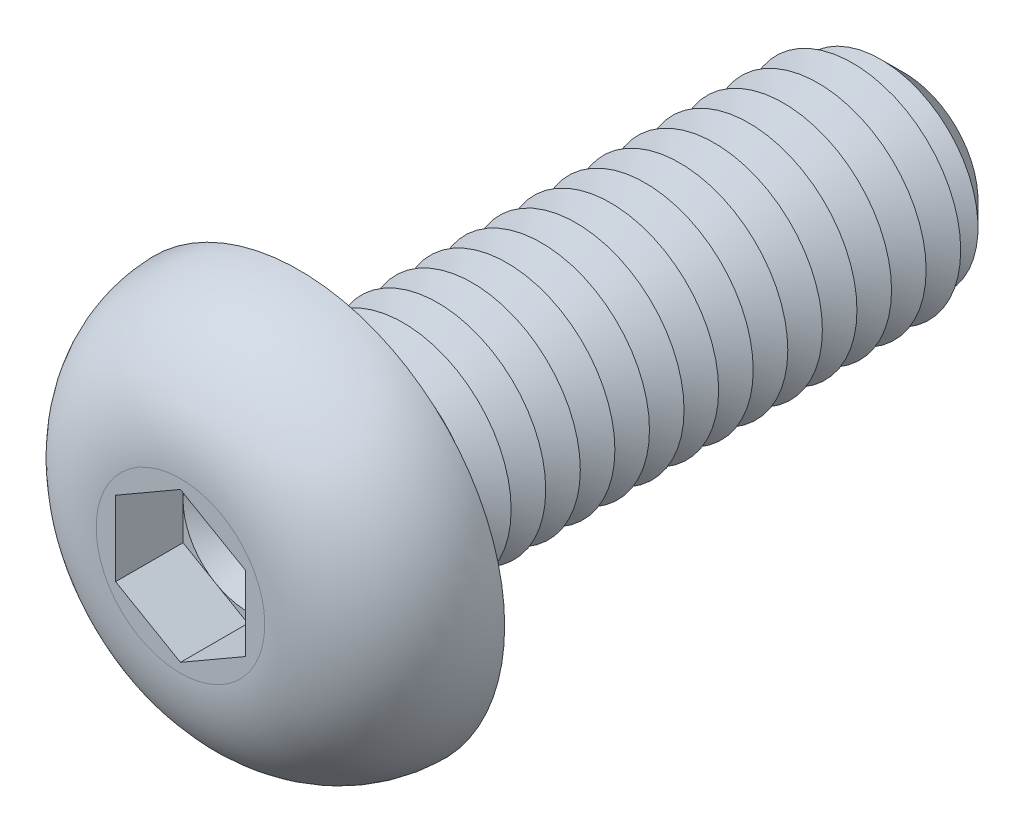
from build123d import *

# Parameters (mm, degrees)
CUT_EXTRUDE1_DEPTH  = 1.56
SKETCH4_R           = 2.5
BOSS_EXTRUDE1_DEPTH = 14
CHAMFER1_SIZE       = 0.8
LPATTERN1_COUNT     = 16
LPATTERN1_PITCH     = 0.8
FILLET2_R           = 0.4


with BuildPart() as part:
    # Sketch2 → Revolve1 (revolve)
    with BuildSketch(Plane(origin=(0, 0, 0), x_dir=(0, 0, -1), z_dir=(1, 0, 0)), mode=Mode.PRIVATE) as revolve1_sk:
        with BuildLine():
            Line((0, 0), (-2.75, 0))
            Line((-2.75, 0), (-2.75, 1.950446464))
            ThreePointArc((-2.75, 1.950446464), (-1.947498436, 3.912588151), (0, 4.75))
            Line((0, 4.75), (0, 0))
        make_face()
    revolve(revolve1_sk.sketch.rotate(Axis((0, 0, 47.934239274), (0, 0, -1)), 90), axis=Axis((0, 0, 47.934239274), (0, 0, -1)))

    # Sketch3 → Cut-Extrude1 (cut)
    with BuildSketch(Plane.XY.offset(2.75)):
        Polygon((0, 1.732050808), (-1.5, 0.866025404), (-1.5, -0.866025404), (0, -1.732050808), (1.5, -0.866025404), (1.5, 0.866025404), align=None)
    extrude(amount=-CUT_EXTRUDE1_DEPTH, mode=Mode.SUBTRACT)

    # Sketch4 → Boss-Extrude1 (add)
    with BuildSketch(Plane(origin=(0, 0, 0), x_dir=(-1, 0, 0), z_dir=(0, 0, -1))):
        with Locations(Location((0, 0, 0), (0, 0, 180))):
            Circle(SKETCH4_R)
    extrude(amount=BOSS_EXTRUDE1_DEPTH)

    # Chamfer1
    chamfer1_edges = [part.edges().sort_by_distance(p)[0] for p in [
        (-2.5, 0, -14),
    ]]
    chamfer(chamfer1_edges, length=CHAMFER1_SIZE)

    # Sketch5 → Cut-Revolve1 (revolve, cut)
    with BuildSketch(Plane(origin=(0, 0, 0), x_dir=(0, 0, -1), z_dir=(1, 0, 0)), mode=Mode.PRIVATE) as cut_revolve1_sk:
        Polygon((0.8, 2.5), (1.6, 2.5), (1.2, 1.807179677), align=None)
    cut_revolve1 = revolve(cut_revolve1_sk.sketch.rotate(Axis((0, 0, 47.934239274), (0, 0, -1)), 90), axis=Axis((0, 0, 47.934239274), (0, 0, -1)), mode=Mode.SUBTRACT)

    # LPattern1: Cut-Revolve1 ×16
    with Locations(*[(0, 0, -i * LPATTERN1_PITCH) for i in range(1, LPATTERN1_COUNT)]):
        add(cut_revolve1, mode=Mode.SUBTRACT)

    # Fillet2
    fillet2_edges = [part.edges().sort_by_distance(p)[0] for p in [
        (-2.5, 0, 0),
    ]]
    fillet(fillet2_edges, radius=FILLET2_R)

    # Cut-Extrude2 cone 1 section (on through the dimple's axis) → Cut-Extrude2 (revolve, cut)
    with BuildSketch(Plane(origin=(0, 0, 1.19), x_dir=(0, -1, 0), z_dir=(1, 0, 0))):
        Polygon((0, 0), (1.5, 0), (0, 0.866025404), align=None)
    revolve(axis=Axis((0, 0, 1.19), (0, 0, -1)), mode=Mode.SUBTRACT)


solid = part.part
